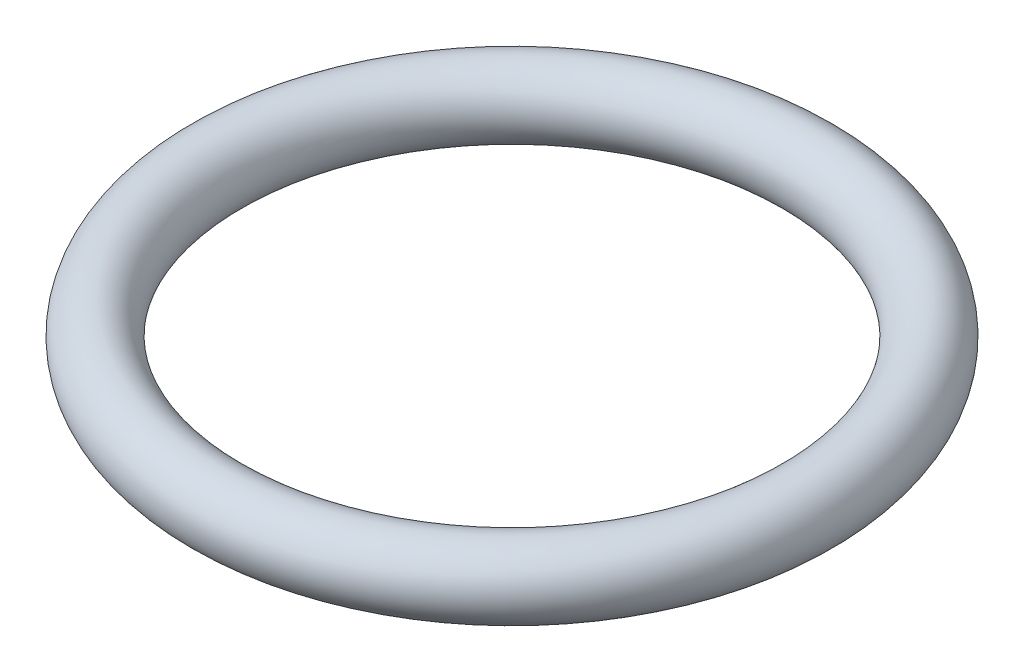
from build123d import *

# Parameters (mm, degrees)
ESQUISSE1_R = 1


with BuildPart() as part:
    # Esquisse1 → R_volution1 (revolve)
    with BuildSketch(Plane.XY, mode=Mode.PRIVATE) as r_volution1_sk:
        with Locations((8.5, 0)):
            Circle(ESQUISSE1_R)
    revolve(r_volution1_sk.sketch.rotate(Axis((0, 0, 0), (0, 1, 0)), 90), axis=Axis((0, 0, 0), (0, 1, 0)))


solid = part.part
